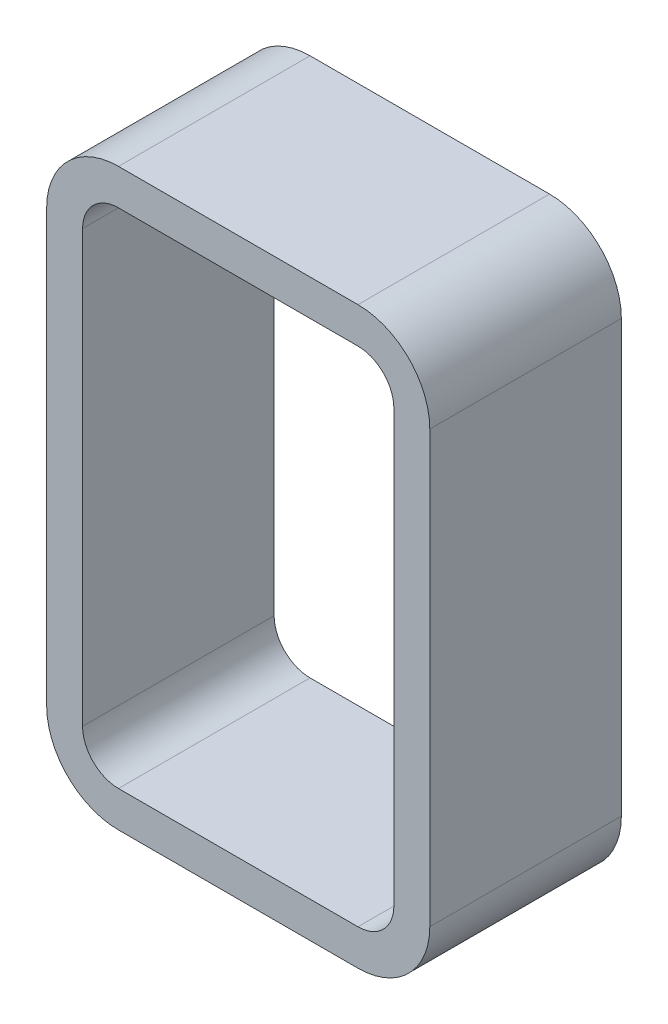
from build123d import *

# Parameters (mm, degrees)
BASETUBER_DEPTH = 12.7


with BuildPart() as part:
    # Sketch1 → BaseTubeR (new, symmetric)
    with BuildSketch(Plane.XY):
        with BuildLine():
            Line((9.52499175, 0), (41.27496425, 0))
            ThreePointArc((41.27496425, 0), (48.010150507, 2.789805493), (50.799956, 9.52499175))
            Line((50.799956, 9.52499175), (50.799956, 66.67500825))
            ThreePointArc((50.799956, 66.67500825), (48.010150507, 73.410194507), (41.27496425, 76.2))
            Line((41.27496425, 76.2), (9.52499175, 76.2))
            ThreePointArc((9.52499175, 76.2), (2.789805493, 73.410194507), (0, 66.67500825))
            Line((0, 66.67500825), (0, 9.52499175))
            ThreePointArc((0, 9.52499175), (2.789805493, 2.789805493), (9.52499175, 0))
        make_face()
        with BuildLine():
            Line((9.52499175, 4.762495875), (41.27496425, 4.762495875))
            ThreePointArc((41.27496425, 4.762495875), (44.642557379, 6.157398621), (46.037460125, 9.52499175))
            Line((46.037460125, 9.52499175), (46.037460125, 66.67500825))
            ThreePointArc((46.037460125, 66.67500825), (44.642557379, 70.042601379), (41.27496425, 71.437504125))
            Line((41.27496425, 71.437504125), (9.52499175, 71.437504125))
            ThreePointArc((9.52499175, 71.437504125), (6.157398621, 70.042601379), (4.762495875, 66.67500825))
            Line((4.762495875, 66.67500825), (4.762495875, 9.52499175))
            ThreePointArc((4.762495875, 9.52499175), (6.157398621, 6.157398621), (9.52499175, 4.762495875))
        make_face(mode=Mode.SUBTRACT)
    extrude(amount=BASETUBER_DEPTH, both=True)


solid = part.part
